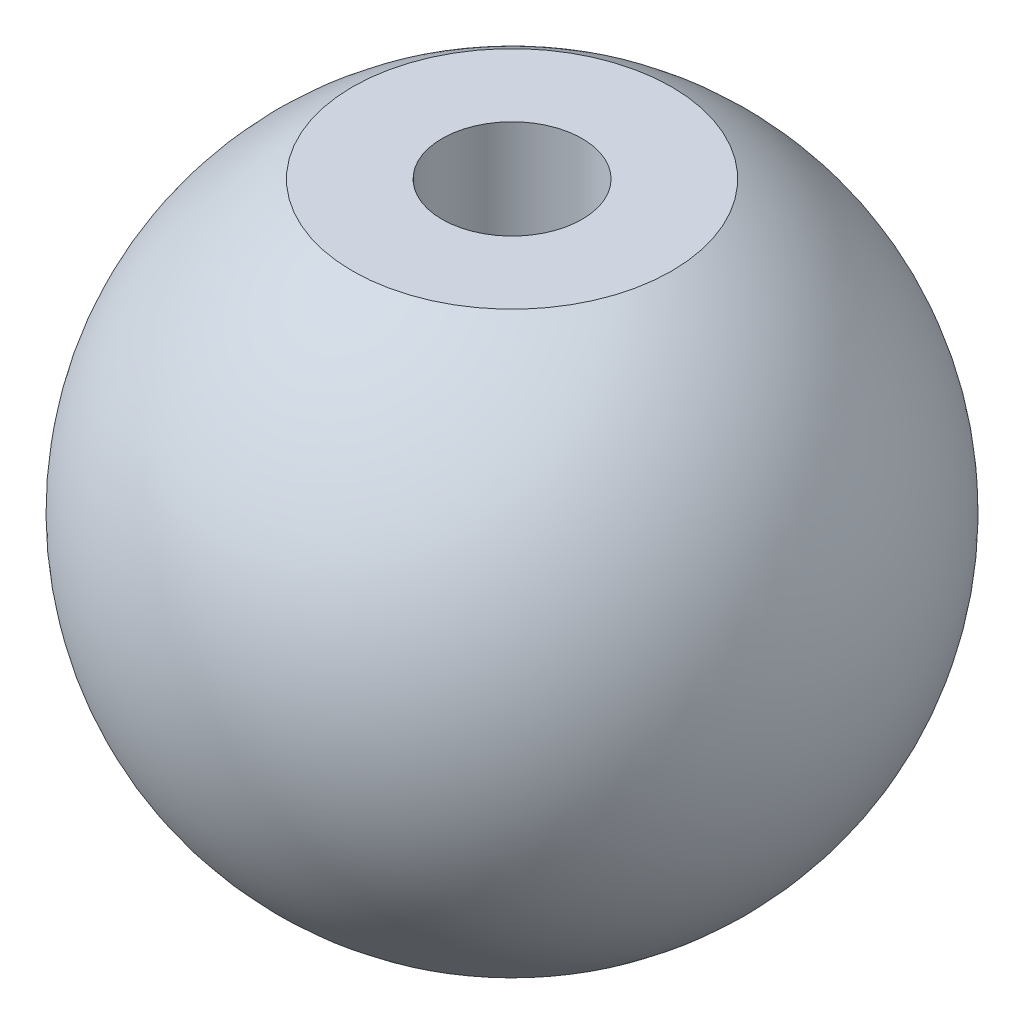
from build123d import *

# Parameters (mm, degrees)
TROU_TARAUD_M81_D     = 6.8
TROU_TARAUD_M81_DEPTH = 22.25
TROU_TARAUD_M81_TIP   = 2.042926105


with BuildPart() as part:
    # Esquisse1 → R_volution1 (revolve)
    with BuildSketch(Plane.XY):
        with BuildLine():
            Line((-7.745966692, 14), (0, 14))
            Line((0, 14), (0, -16))
            ThreePointArc((0, -16), (-15.491933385, -4), (-7.745966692, 14))
        make_face()
    revolve(axis=Axis((0, 26.234817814, 0), (0, -1, 0)))

    # Trou taraud_ M81
    with Locations(Plane(origin=(0, 14, 0), x_dir=(1, 0, 0), z_dir=(0, 1, 0))):
        with Locations((0, 0)):
            Hole(TROU_TARAUD_M81_D / 2, depth=TROU_TARAUD_M81_DEPTH)
            with Locations((0, 0, -(TROU_TARAUD_M81_DEPTH + TROU_TARAUD_M81_TIP / 2))):  # 118° drill point
                Cone(0, TROU_TARAUD_M81_D / 2, TROU_TARAUD_M81_TIP, mode=Mode.SUBTRACT)


solid = part.part
